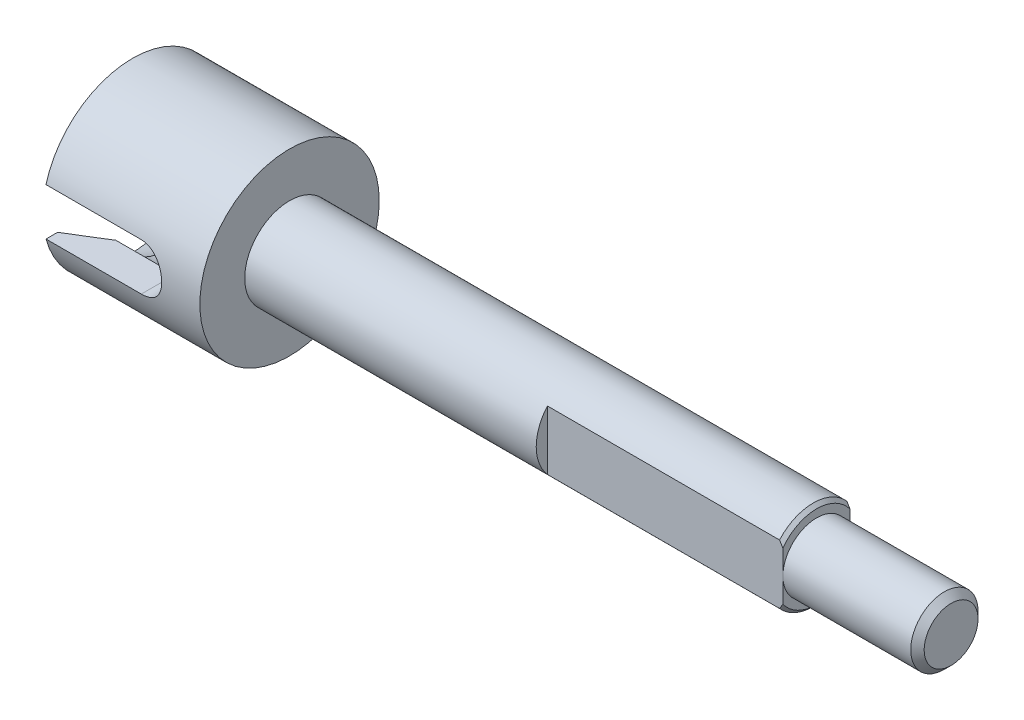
ISO-10303-21;
HEADER;
FILE_DESCRIPTION(('STEP AP214'),'2;1');
FILE_NAME('part.step','',(''),(''),'','','');
FILE_SCHEMA(('AUTOMOTIVE_DESIGN { 1 0 10303 214 1 1 1 1 }'));
ENDSEC;
DATA;
#1=APPLICATION_CONTEXT('core data for automotive mechanical design processes');
#2=APPLICATION_PROTOCOL_DEFINITION('international standard','automotive_design',2000,#1);
#3=PRODUCT_CONTEXT('',#1,'mechanical');
#4=PRODUCT('Part','Part','',(#3));
#5=PRODUCT_RELATED_PRODUCT_CATEGORY('part','',(#4));
#6=PRODUCT_DEFINITION_FORMATION('','',#4);
#7=PRODUCT_DEFINITION_CONTEXT('part definition',#1,'design');
#8=PRODUCT_DEFINITION('design','',#6,#7);
#9=PRODUCT_DEFINITION_SHAPE('','',#8);
#10=(LENGTH_UNIT() NAMED_UNIT(*) SI_UNIT(.MILLI.,.METRE.));
#11=(NAMED_UNIT(*) PLANE_ANGLE_UNIT() SI_UNIT($,.RADIAN.));
#12=(NAMED_UNIT(*) SI_UNIT($,.STERADIAN.) SOLID_ANGLE_UNIT());
#13=UNCERTAINTY_MEASURE_WITH_UNIT(LENGTH_MEASURE(1.E-05),#10,'distance_accuracy_value','');
#14=(GEOMETRIC_REPRESENTATION_CONTEXT(3) GLOBAL_UNCERTAINTY_ASSIGNED_CONTEXT((#13)) GLOBAL_UNIT_ASSIGNED_CONTEXT((#10,
#11,#12)) REPRESENTATION_CONTEXT('',''));
#15=CARTESIAN_POINT('',(0.,0.,0.));
#16=DIRECTION('',(0.,0.,1.));
#17=DIRECTION('',(1.,0.,0.));
#18=AXIS2_PLACEMENT_3D('',#15,#16,#17);
#19=CARTESIAN_POINT('',(-3.40000000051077,0.,0.));
#20=DIRECTION('',(-1.,0.,0.));
#21=DIRECTION('',(0.,0.,1.));
#22=AXIS2_PLACEMENT_3D('',#19,#20,#21);
#23=CONICAL_SURFACE('',#22,5.15000000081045,1.04719755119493);
#24=CARTESIAN_POINT('',(-0.426646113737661,0.,0.));
#25=VERTEX_POINT('',#24);
#26=VERTEX_LOOP('',#25);
#27=FACE_BOUND('',#26,.T.);
#28=CARTESIAN_POINT('',(-3.4,0.,0.));
#29=DIRECTION('',(-1.,0.,0.));
#30=DIRECTION('',(0.,0.,1.));
#31=AXIS2_PLACEMENT_3D('',#28,#29,#30);
#32=CIRCLE('',#31,5.15);
#33=CARTESIAN_POINT('',(-3.4,0.,5.15));
#34=VERTEX_POINT('',#33);
#35=CARTESIAN_POINT('',(-3.4,5.72113442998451E-08,-5.15));
#36=VERTEX_POINT('',#35);
#37=EDGE_CURVE('E321',#34,#36,#32,.T.);
#38=ORIENTED_EDGE('',*,*,#37,.T.);
#39=CARTESIAN_POINT('',(-3.4,0.,0.));
#40=DIRECTION('',(-1.,0.,0.));
#41=DIRECTION('',(0.,0.,1.));
#42=AXIS2_PLACEMENT_3D('',#39,#40,#41);
#43=CIRCLE('',#42,5.15);
#44=EDGE_CURVE('E326',#36,#34,#43,.T.);
#45=ORIENTED_EDGE('',*,*,#44,.T.);
#46=EDGE_LOOP('',(#38,#45));
#47=FACE_BOUND('',#46,.T.);
#48=ADVANCED_FACE('F16',(#27,#47),#23,.F.);
#49=CARTESIAN_POINT('',(59.,0.,0.));
#50=DIRECTION('',(1.,0.,0.));
#51=DIRECTION('',(0.,0.,-1.));
#52=AXIS2_PLACEMENT_3D('',#49,#50,#51);
#53=PLANE('',#52);
#54=CARTESIAN_POINT('',(59.,0.,0.));
#55=DIRECTION('',(1.,0.,0.));
#56=DIRECTION('',(0.,0.,-1.));
#57=AXIS2_PLACEMENT_3D('',#54,#55,#56);
#58=CIRCLE('',#57,2.39993252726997);
#59=CARTESIAN_POINT('',(59.,0.,-2.39993252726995));
#60=VERTEX_POINT('',#59);
#61=EDGE_CURVE('E20',#60,#60,#58,.F.);
#62=ORIENTED_EDGE('',*,*,#61,.F.);
#63=EDGE_LOOP('',(#62));
#64=FACE_BOUND('',#63,.T.);
#65=ADVANCED_FACE('F506',(#64),#53,.T.);
#66=CARTESIAN_POINT('',(-13.9999999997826,0.,0.));
#67=DIRECTION('',(-1.,0.,0.));
#68=DIRECTION('',(0.,0.,1.));
#69=AXIS2_PLACEMENT_3D('',#66,#67,#68);
#70=CONICAL_SURFACE('',#69,6.99999999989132,0.523598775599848);
#71=CARTESIAN_POINT('',(-10.7957060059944,-2.1,-4.70239300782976));
#72=CARTESIAN_POINT('',(-11.0608600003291,-2.1,-4.87001047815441));
#73=CARTESIAN_POINT('',(-11.3266459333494,-2.1,-5.03662211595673));
#74=CARTESIAN_POINT('',(-11.8592172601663,-2.1,-5.36822748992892));
#75=CARTESIAN_POINT('',(-12.1260026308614,-2.1,-5.53322126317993));
#76=CARTESIAN_POINT('',(-12.660318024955,-2.1,-5.86199073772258));
#77=CARTESIAN_POINT('',(-12.9278480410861,-2.1,-6.02576645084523));
#78=CARTESIAN_POINT('',(-13.4635109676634,-2.1,-6.35234304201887));
#79=CARTESIAN_POINT('',(-13.7316438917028,-2.1,-6.51514389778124));
#80=CARTESIAN_POINT('',(-13.9999999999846,-2.1,-6.67757440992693));
#81=B_SPLINE_CURVE_WITH_KNOTS('',3,(#71,#72,#73,#74,#75,#76,#77,#78,#79,#80),.UNSPECIFIED.,.F.,
.F.,(4,2,2,2,4),(0.,0.9410670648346,1.88211250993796,2.82314880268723,3.76420652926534),.UNSPECIFIED.);
#82=CARTESIAN_POINT('',(-10.7957060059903,-2.1,-4.7023930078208));
#83=VERTEX_POINT('',#82);
#84=CARTESIAN_POINT('',(-13.9999999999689,-2.1,-6.67757440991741));
#85=VERTEX_POINT('',#84);
#86=EDGE_CURVE('E149',#83,#85,#81,.T.);
#87=ORIENTED_EDGE('',*,*,#86,.T.);
#88=CARTESIAN_POINT('',(-13.9999999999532,0.,0.));
#89=DIRECTION('',(-1.,0.,0.));
#90=DIRECTION('',(0.,0.,1.));
#91=AXIS2_PLACEMENT_3D('',#88,#89,#90);
#92=CIRCLE('',#91,6.99999999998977);
#93=CARTESIAN_POINT('',(-13.9999999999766,-2.1,6.67757440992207));
#94=VERTEX_POINT('',#93);
#95=EDGE_CURVE('E142',#85,#94,#92,.T.);
#96=ORIENTED_EDGE('',*,*,#95,.T.);
#97=CARTESIAN_POINT('',(-13.9999999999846,-2.1,6.67757440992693));
#98=CARTESIAN_POINT('',(-13.7316438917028,-2.1,6.51514389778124));
#99=CARTESIAN_POINT('',(-13.4635109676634,-2.1,6.35234304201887));
#100=CARTESIAN_POINT('',(-12.9278480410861,-2.1,6.02576645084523));
#101=CARTESIAN_POINT('',(-12.660318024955,-2.1,5.86199073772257));
#102=CARTESIAN_POINT('',(-12.1260026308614,-2.1,5.53322126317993));
#103=CARTESIAN_POINT('',(-11.8592172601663,-2.1,5.36822748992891));
#104=CARTESIAN_POINT('',(-11.3266459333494,-2.1,5.03662211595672));
#105=CARTESIAN_POINT('',(-11.0608600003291,-2.1,4.87001047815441));
#106=CARTESIAN_POINT('',(-10.7957060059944,-2.1,4.70239300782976));
#107=B_SPLINE_CURVE_WITH_KNOTS('',3,(#97,#98,#99,#100,#101,#102,#103,#104,#105,#106),
.UNSPECIFIED.,.F.,.F.,(4,2,2,2,4),(0.,0.941057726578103,1.88209401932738,2.82313946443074,
3.76420652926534),.UNSPECIFIED.);
#108=CARTESIAN_POINT('',(-10.7957060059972,-2.1,4.70239300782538));
#109=VERTEX_POINT('',#108);
#110=EDGE_CURVE('E146',#94,#109,#107,.T.);
#111=ORIENTED_EDGE('',*,*,#110,.T.);
#112=CARTESIAN_POINT('',(-10.795706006,0.,0.));
#113=DIRECTION('',(-1.,0.,0.));
#114=DIRECTION('',(0.,0.,1.));
#115=AXIS2_PLACEMENT_3D('',#112,#113,#114);
#116=CIRCLE('',#115,5.15);
#117=EDGE_CURVE('E324',#109,#83,#116,.F.);
#118=ORIENTED_EDGE('',*,*,#117,.T.);
#119=EDGE_LOOP('',(#87,#96,#111,#118));
#120=FACE_BOUND('',#119,.T.);
#121=ADVANCED_FACE('F144',(#120),#70,.F.);
#122=CARTESIAN_POINT('',(-13.9999999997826,0.,0.));
#123=DIRECTION('',(-1.,0.,0.));
#124=DIRECTION('',(0.,0.,1.));
#125=AXIS2_PLACEMENT_3D('',#122,#123,#124);
#126=CONICAL_SURFACE('',#125,6.99999999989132,0.523598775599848);
#127=CARTESIAN_POINT('',(-10.795706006,0.,0.));
#128=DIRECTION('',(-1.,0.,0.));
#129=DIRECTION('',(0.,0.,1.));
#130=AXIS2_PLACEMENT_3D('',#127,#128,#129);
#131=CIRCLE('',#130,5.15);
#132=CARTESIAN_POINT('',(-10.7957060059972,2.1,-4.70239300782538));
#133=VERTEX_POINT('',#132);
#134=CARTESIAN_POINT('',(-10.7957060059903,2.1,4.7023930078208));
#135=VERTEX_POINT('',#134);
#136=EDGE_CURVE('E319',#133,#135,#131,.F.);
#137=ORIENTED_EDGE('',*,*,#136,.T.);
#138=CARTESIAN_POINT('',(-10.7957060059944,2.1,4.70239300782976));
#139=CARTESIAN_POINT('',(-11.0608600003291,2.1,4.87001047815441));
#140=CARTESIAN_POINT('',(-11.3266459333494,2.1,5.03662211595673));
#141=CARTESIAN_POINT('',(-11.8592172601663,2.1,5.36822748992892));
#142=CARTESIAN_POINT('',(-12.1260026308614,2.1,5.53322126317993));
#143=CARTESIAN_POINT('',(-12.660318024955,2.1,5.86199073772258));
#144=CARTESIAN_POINT('',(-12.9278480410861,2.1,6.02576645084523));
#145=CARTESIAN_POINT('',(-13.4635109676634,2.1,6.35234304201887));
#146=CARTESIAN_POINT('',(-13.7316438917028,2.1,6.51514389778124));
#147=CARTESIAN_POINT('',(-13.9999999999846,2.1,6.67757440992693));
#148=B_SPLINE_CURVE_WITH_KNOTS('',3,(#138,#139,#140,#141,#142,#143,#144,#145,#146,#147),
.UNSPECIFIED.,.F.,.F.,(4,2,2,2,4),(0.,0.9410670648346,1.88211250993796,2.82314880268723,
3.76420652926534),.UNSPECIFIED.);
#149=CARTESIAN_POINT('',(-13.9999999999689,2.1,6.67757440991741));
#150=VERTEX_POINT('',#149);
#151=EDGE_CURVE('E210',#135,#150,#148,.T.);
#152=ORIENTED_EDGE('',*,*,#151,.T.);
#153=CARTESIAN_POINT('',(-13.9999999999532,0.,0.));
#154=DIRECTION('',(-1.,0.,0.));
#155=DIRECTION('',(0.,0.,1.));
#156=AXIS2_PLACEMENT_3D('',#153,#154,#155);
#157=CIRCLE('',#156,6.99999999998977);
#158=CARTESIAN_POINT('',(-13.9999999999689,2.1,-6.67757440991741));
#159=VERTEX_POINT('',#158);
#160=EDGE_CURVE('E224',#150,#159,#157,.T.);
#161=ORIENTED_EDGE('',*,*,#160,.T.);
#162=CARTESIAN_POINT('',(-13.9999999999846,2.1,-6.67757440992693));
#163=CARTESIAN_POINT('',(-13.7316438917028,2.1,-6.51514389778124));
#164=CARTESIAN_POINT('',(-13.4635109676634,2.1,-6.35234304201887));
#165=CARTESIAN_POINT('',(-12.9278480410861,2.1,-6.02576645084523));
#166=CARTESIAN_POINT('',(-12.660318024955,2.1,-5.86199073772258));
#167=CARTESIAN_POINT('',(-12.1260026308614,2.1,-5.53322126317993));
#168=CARTESIAN_POINT('',(-11.8592172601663,2.1,-5.36822748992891));
#169=CARTESIAN_POINT('',(-11.3266459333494,2.1,-5.03662211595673));
#170=CARTESIAN_POINT('',(-11.0608600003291,2.1,-4.87001047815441));
#171=CARTESIAN_POINT('',(-10.7957060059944,2.1,-4.70239300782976));
#172=B_SPLINE_CURVE_WITH_KNOTS('',3,(#162,#163,#164,#165,#166,#167,#168,#169,#170,#171),
.UNSPECIFIED.,.F.,.F.,(4,2,2,2,4),(0.,0.941057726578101,1.88209401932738,2.82313946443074,
3.76420652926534),.UNSPECIFIED.);
#173=EDGE_CURVE('E166',#159,#133,#172,.T.);
#174=ORIENTED_EDGE('',*,*,#173,.T.);
#175=EDGE_LOOP('',(#137,#152,#161,#174));
#176=FACE_BOUND('',#175,.T.);
#177=ADVANCED_FACE('F225',(#176),#126,.F.);
#178=CARTESIAN_POINT('',(0.2520215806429,0.,0.));
#179=DIRECTION('',(-1.,0.,0.));
#180=DIRECTION('',(0.,0.,1.));
#181=AXIS2_PLACEMENT_3D('',#178,#179,#180);
#182=CYLINDRICAL_SURFACE('',#181,5.15);
#183=ORIENTED_EDGE('',*,*,#37,.F.);
#184=CARTESIAN_POINT('',(-3.4,0.,5.15));
#185=CARTESIAN_POINT('',(-3.39999196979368,0.056592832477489,5.15000858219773));
#186=CARTESIAN_POINT('',(-3.40228748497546,0.113180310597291,5.14906737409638));
#187=CARTESIAN_POINT('',(-3.41142323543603,0.225909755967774,5.14534945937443));
#188=CARTESIAN_POINT('',(-3.41826208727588,0.282051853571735,5.14257331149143));
#189=CARTESIAN_POINT('',(-3.4363896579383,0.393290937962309,5.13526265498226));
#190=CARTESIAN_POINT('',(-3.44766233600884,0.448390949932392,5.1307344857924));
#191=CARTESIAN_POINT('',(-3.47453374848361,0.55735018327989,5.12004522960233));
#192=CARTESIAN_POINT('',(-3.49013266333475,0.611209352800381,5.11388407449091));
#193=CARTESIAN_POINT('',(-3.54319014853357,0.770296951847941,5.09318431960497));
#194=CARTESIAN_POINT('',(-3.58693939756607,0.873216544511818,5.07641677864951));
#195=CARTESIAN_POINT('',(-3.68974879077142,1.070220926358,5.03857461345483));
#196=CARTESIAN_POINT('',(-3.74882075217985,1.16429881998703,5.017496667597));
#197=CARTESIAN_POINT('',(-3.88358529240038,1.34554852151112,4.97203194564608));
#198=CARTESIAN_POINT('',(-3.95989199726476,1.43223806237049,4.94754074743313));
#199=CARTESIAN_POINT('',(-4.12566235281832,1.59199846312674,4.89847334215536));
#200=CARTESIAN_POINT('',(-4.21513202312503,1.66506305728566,4.87389710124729));
#201=CARTESIAN_POINT('',(-4.40979601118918,1.7989032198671,4.82615183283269));
#202=CARTESIAN_POINT('',(-4.51553298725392,1.85893655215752,4.80310386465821));
#203=CARTESIAN_POINT('',(-4.73661697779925,1.9600974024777,4.76271965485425));
#204=CARTESIAN_POINT('',(-4.85195002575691,2.00125184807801,4.7453752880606));
#205=CARTESIAN_POINT('',(-5.05635703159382,2.05452562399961,4.72250387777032));
#206=CARTESIAN_POINT('',(-5.14397112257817,2.07151018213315,4.71504127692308));
#207=CARTESIAN_POINT('',(-5.32102792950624,2.09427595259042,4.70494946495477));
#208=CARTESIAN_POINT('',(-5.41047292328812,2.1000422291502,4.70232669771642));
#209=CARTESIAN_POINT('',(-5.5,2.1,4.70239300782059));
#210=B_SPLINE_CURVE_WITH_KNOTS('',3,(#184,#185,#186,#187,#188,#189,#190,#191,#192,#193,#194,
#195,#196,#197,#198,#199,#200,#201,#202,#203,#204,#205,#206,#207,#208,#209),.UNSPECIFIED.,.F.,
.F.,(4,2,2,2,2,2,2,2,2,2,2,2,4),(0.,0.169715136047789,0.33937861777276,0.508433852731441,
0.677496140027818,1.01507576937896,1.35291652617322,1.70553903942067,2.0583233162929,
2.42774830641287,2.79664472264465,3.06450234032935,3.33271633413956),.UNSPECIFIED.);
#211=CARTESIAN_POINT('',(-5.5,2.1,4.7023930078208));
#212=VERTEX_POINT('',#211);
#213=EDGE_CURVE('E245',#34,#212,#210,.T.);
#214=ORIENTED_EDGE('',*,*,#213,.T.);
#215=DIRECTION('',(1.,0.,0.));
#216=VECTOR('',#215,1.);
#217=CARTESIAN_POINT('',(-5.5,2.1,4.702393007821));
#218=LINE('',#217,#216);
#219=EDGE_CURVE('E217',#212,#135,#218,.F.);
#220=ORIENTED_EDGE('',*,*,#219,.T.);
#221=ORIENTED_EDGE('',*,*,#136,.F.);
#222=DIRECTION('',(1.,0.,0.));
#223=VECTOR('',#222,1.);
#224=CARTESIAN_POINT('',(-5.5,2.1,-4.702393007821));
#225=LINE('',#224,#223);
#226=CARTESIAN_POINT('',(-5.5,2.1,-4.7023930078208));
#227=VERTEX_POINT('',#226);
#228=EDGE_CURVE('E476',#133,#227,#225,.T.);
#229=ORIENTED_EDGE('',*,*,#228,.T.);
#230=CARTESIAN_POINT('',(-5.5,2.1,-4.70239300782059));
#231=CARTESIAN_POINT('',(-5.4436048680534,2.10000848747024,-4.70238109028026));
#232=CARTESIAN_POINT('',(-5.38721624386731,2.09772851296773,-4.70340722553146));
#233=CARTESIAN_POINT('',(-5.27489629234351,2.08865800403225,-4.70744650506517));
#234=CARTESIAN_POINT('',(-5.21896479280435,2.08186925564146,-4.71045886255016));
#235=CARTESIAN_POINT('',(-5.10818741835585,2.06388470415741,-4.71836525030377));
#236=CARTESIAN_POINT('',(-5.05333801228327,2.05270722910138,-4.72325145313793));
#237=CARTESIAN_POINT('',(-4.94488445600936,2.02607221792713,-4.73473766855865));
#238=CARTESIAN_POINT('',(-4.8912803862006,2.01061440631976,-4.74133779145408));
#239=CARTESIAN_POINT('',(-4.73299676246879,1.95806782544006,-4.76339445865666));
#240=CARTESIAN_POINT('',(-4.63062004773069,1.91476867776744,-4.78112473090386));
#241=CARTESIAN_POINT('',(-4.43453349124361,1.81301474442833,-4.8206267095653));
#242=CARTESIAN_POINT('',(-4.3408327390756,1.75454430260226,-4.84240258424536));
#243=CARTESIAN_POINT('',(-4.15925775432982,1.62043508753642,-4.88896560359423));
#244=CARTESIAN_POINT('',(-4.07196134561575,1.54404660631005,-4.91385143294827));
#245=CARTESIAN_POINT('',(-3.91100449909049,1.37785430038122,-4.96301523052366));
#246=CARTESIAN_POINT('',(-3.83734724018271,1.28804735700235,-4.98729305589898));
#247=CARTESIAN_POINT('',(-3.70277313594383,1.09297256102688,-5.0337228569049));
#248=CARTESIAN_POINT('',(-3.6425154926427,0.987216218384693,-5.05574400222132));
#249=CARTESIAN_POINT('',(-3.54094020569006,0.766063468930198,-5.09393631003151));
#250=CARTESIAN_POINT('',(-3.49960056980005,0.65067844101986,-5.1101142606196));
#251=CARTESIAN_POINT('',(-3.445909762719,0.445770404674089,-5.13140990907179));
#252=CARTESIAN_POINT('',(-3.4287450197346,0.357678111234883,-5.13833462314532));
#253=CARTESIAN_POINT('',(-3.41152641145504,0.224264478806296,-5.1453082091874));
#254=CARTESIAN_POINT('',(-3.40720826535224,0.17955138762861,-5.14706385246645));
#255=CARTESIAN_POINT('',(-3.40144373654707,0.0898961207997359,-5.14941117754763));
#256=CARTESIAN_POINT('',(-3.39999825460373,0.0449538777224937,-5.15000249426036));
#257=CARTESIAN_POINT('',(-3.4,7.62817921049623E-08,-5.15));
#258=B_SPLINE_CURVE_WITH_KNOTS('',3,(#230,#231,#232,#233,#234,#235,#236,#237,#238,#239,#240,
#241,#242,#243,#244,#245,#246,#247,#248,#249,#250,#251,#252,#253,#254,#255,#256,#257),
.UNSPECIFIED.,.F.,.F.,(4,2,2,2,2,2,2,2,2,2,2,2,2,4),(0.,0.169119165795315,0.338171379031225,
0.506524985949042,0.674889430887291,1.01093859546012,1.34733593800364,1.70168615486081,
2.05611885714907,2.42532849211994,2.79410782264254,3.06329759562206,3.19806701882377,
3.33287869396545),.UNSPECIFIED.);
#259=EDGE_CURVE('E240',#227,#36,#258,.T.);
#260=ORIENTED_EDGE('',*,*,#259,.T.);
#261=EDGE_LOOP('',(#183,#214,#220,#221,#229,#260));
#262=FACE_BOUND('',#261,.T.);
#263=ADVANCED_FACE('F229',(#262),#182,.F.);
#264=CARTESIAN_POINT('',(0.2520215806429,0.,0.));
#265=DIRECTION('',(-1.,0.,0.));
#266=DIRECTION('',(0.,0.,1.));
#267=AXIS2_PLACEMENT_3D('',#264,#265,#266);
#268=CYLINDRICAL_SURFACE('',#267,5.15);
#269=DIRECTION('',(1.,0.,0.));
#270=VECTOR('',#269,1.);
#271=CARTESIAN_POINT('',(-14.,-2.1,-4.702393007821));
#272=LINE('',#271,#270);
#273=CARTESIAN_POINT('',(-5.5,-2.1,-4.7023930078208));
#274=VERTEX_POINT('',#273);
#275=EDGE_CURVE('E469',#274,#83,#272,.F.);
#276=ORIENTED_EDGE('',*,*,#275,.T.);
#277=ORIENTED_EDGE('',*,*,#117,.F.);
#278=DIRECTION('',(1.,0.,0.));
#279=VECTOR('',#278,1.);
#280=CARTESIAN_POINT('',(-14.,-2.1,4.702393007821));
#281=LINE('',#280,#279);
#282=CARTESIAN_POINT('',(-5.5,-2.1,4.7023930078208));
#283=VERTEX_POINT('',#282);
#284=EDGE_CURVE('E164',#109,#283,#281,.T.);
#285=ORIENTED_EDGE('',*,*,#284,.T.);
#286=CARTESIAN_POINT('',(-5.5,-2.1,4.70239300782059));
#287=CARTESIAN_POINT('',(-5.44360486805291,-2.10000848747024,4.70238109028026));
#288=CARTESIAN_POINT('',(-5.38721624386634,-2.0977285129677,4.70340722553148));
#289=CARTESIAN_POINT('',(-5.27489629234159,-2.08865800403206,4.70744650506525));
#290=CARTESIAN_POINT('',(-5.21896479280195,-2.08186925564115,4.7104588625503));
#291=CARTESIAN_POINT('',(-5.10818741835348,-2.06388470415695,4.71836525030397));
#292=CARTESIAN_POINT('',(-5.05333801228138,-2.05270722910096,4.72325145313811));
#293=CARTESIAN_POINT('',(-4.94488445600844,-2.02607221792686,4.73473766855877));
#294=CARTESIAN_POINT('',(-4.89128038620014,-2.01061440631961,4.74133779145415));
#295=CARTESIAN_POINT('',(-4.73299676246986,-1.95806782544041,4.76339445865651));
#296=CARTESIAN_POINT('',(-4.63062004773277,-1.9147686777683,4.7811247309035));
#297=CARTESIAN_POINT('',(-4.43453349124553,-1.81301474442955,4.82062670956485));
#298=CARTESIAN_POINT('',(-4.34083273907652,-1.75454430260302,4.84240258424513));
#299=CARTESIAN_POINT('',(-4.15925775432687,-1.62043508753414,4.88896560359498));
#300=CARTESIAN_POINT('',(-4.07196134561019,-1.54404660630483,4.91385143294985));
#301=CARTESIAN_POINT('',(-3.91100449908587,-1.37785430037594,4.96301523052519));
#302=CARTESIAN_POINT('',(-3.83734724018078,-1.28804735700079,4.9872930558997));
#303=CARTESIAN_POINT('',(-3.70277313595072,-1.09297256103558,5.03372285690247));
#304=CARTESIAN_POINT('',(-3.64251549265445,-0.987216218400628,5.05574400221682));
#305=CARTESIAN_POINT('',(-3.54094020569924,-0.766063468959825,5.09393631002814));
#306=CARTESIAN_POINT('',(-3.49960056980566,-0.650678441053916,5.11011426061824));
#307=CARTESIAN_POINT('',(-3.44590975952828,-0.445770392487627,5.13140991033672));
#308=CARTESIAN_POINT('',(-3.42874501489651,-0.357678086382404,5.13833462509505));
#309=CARTESIAN_POINT('',(-3.41152640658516,-0.224264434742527,5.1453082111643));
#310=CARTESIAN_POINT('',(-3.40720826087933,-0.179551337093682,5.14706385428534));
#311=CARTESIAN_POINT('',(-3.4014437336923,-0.0898960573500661,5.14941117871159));
#312=CARTESIAN_POINT('',(-3.39999825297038,-0.0449538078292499,5.1500024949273));
#313=CARTESIAN_POINT('',(-3.4,0.,5.15));
#314=B_SPLINE_CURVE_WITH_KNOTS('',3,(#286,#287,#288,#289,#290,#291,#292,#293,#294,#295,#296,
#297,#298,#299,#300,#301,#302,#303,#304,#305,#306,#307,#308,#309,#310,#311,#312,#313),
.UNSPECIFIED.,.F.,.F.,(4,2,2,2,2,2,2,2,2,2,2,2,2,4),(0.,0.169119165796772,0.338171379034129,
0.506524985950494,0.674889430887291,1.01093859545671,1.34733593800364,1.70168615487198,
2.05611885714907,2.42532849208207,2.79410782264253,3.06329763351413,3.19806707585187,
3.33287877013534),.UNSPECIFIED.);
#315=EDGE_CURVE('E218',#283,#34,#314,.T.);
#316=ORIENTED_EDGE('',*,*,#315,.T.);
#317=ORIENTED_EDGE('',*,*,#44,.F.);
#318=CARTESIAN_POINT('',(-3.4,7.62817923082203E-08,-5.15));
#319=CARTESIAN_POINT('',(-3.39999196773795,-0.0565927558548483,-5.15000858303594));
#320=CARTESIAN_POINT('',(-3.40228748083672,-0.113180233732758,-5.14906737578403));
#321=CARTESIAN_POINT('',(-3.41142322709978,-0.225909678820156,-5.14534946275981));
#322=CARTESIAN_POINT('',(-3.41826207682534,-0.282051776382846,-5.14257331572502));
#323=CARTESIAN_POINT('',(-3.43638964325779,-0.39329086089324,-5.13526266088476));
#324=CARTESIAN_POINT('',(-3.44766231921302,-0.448390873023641,-5.13073449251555));
#325=CARTESIAN_POINT('',(-3.47453372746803,-0.557350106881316,-5.12004523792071));
#326=CARTESIAN_POINT('',(-3.49013264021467,-0.611209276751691,-5.1138840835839));
#327=CARTESIAN_POINT('',(-3.54319011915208,-0.770296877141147,-5.09318433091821));
#328=CARTESIAN_POINT('',(-3.5869393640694,-0.873216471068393,-5.07641679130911));
#329=CARTESIAN_POINT('',(-3.68974874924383,-1.07022085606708,-5.03857462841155));
#330=CARTESIAN_POINT('',(-3.74882070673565,-1.16429875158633,-5.01749668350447));
#331=CARTESIAN_POINT('',(-3.88358523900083,-1.34554845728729,-4.97203196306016));
#332=CARTESIAN_POINT('',(-3.9598919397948,-1.43223800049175,-4.94754076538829));
#333=CARTESIAN_POINT('',(-4.1256622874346,-1.59199840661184,-4.8984733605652));
#334=CARTESIAN_POINT('',(-4.21513195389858,-1.6650630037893,-4.87389711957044));
#335=CARTESIAN_POINT('',(-4.40979593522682,-1.79890317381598,-4.826151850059));
#336=CARTESIAN_POINT('',(-4.51553290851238,-1.85893651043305,-4.80310388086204));
#337=CARTESIAN_POINT('',(-4.73661689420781,-1.96009736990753,-4.76271966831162));
#338=CARTESIAN_POINT('',(-4.85194994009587,-2.00125182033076,-4.74537529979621));
#339=CARTESIAN_POINT('',(-5.05635695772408,-2.05452560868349,-4.72250388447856));
#340=CARTESIAN_POINT('',(-5.14397106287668,-2.07151017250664,-4.71504128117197));
#341=CARTESIAN_POINT('',(-5.32102789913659,-2.09427595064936,-4.70494946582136));
#342=CARTESIAN_POINT('',(-5.41047290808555,-2.10004222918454,-4.70232669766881));
#343=CARTESIAN_POINT('',(-5.5,-2.1,-4.70239300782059));
#344=B_SPLINE_CURVE_WITH_KNOTS('',3,(#318,#319,#320,#321,#322,#323,#324,#325,#326,#327,#328,
#329,#330,#331,#332,#333,#334,#335,#336,#337,#338,#339,#340,#341,#342,#343),.UNSPECIFIED.,.F.,
.F.,(4,2,2,2,2,2,2,2,2,2,2,2,4),(0.,0.169715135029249,0.339378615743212,0.508433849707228,
0.677496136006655,1.01507576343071,1.35291651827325,1.70553902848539,2.05832330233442,
2.42774829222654,2.79664470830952,3.06450237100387,3.33271641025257),.UNSPECIFIED.);
#345=EDGE_CURVE('E266',#36,#274,#344,.T.);
#346=ORIENTED_EDGE('',*,*,#345,.T.);
#347=EDGE_LOOP('',(#276,#277,#285,#316,#317,#346));
#348=FACE_BOUND('',#347,.T.);
#349=ADVANCED_FACE('F234',(#348),#268,.F.);
#350=CARTESIAN_POINT('',(58.3999517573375,0.,0.));
#351=DIRECTION('',(-1.,0.,0.));
#352=DIRECTION('',(0.,-1.,0.));
#353=AXIS2_PLACEMENT_3D('',#350,#351,#352);
#354=CONICAL_SURFACE('',#353,2.99996390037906,0.785384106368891);
#355=CARTESIAN_POINT('',(58.3999156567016,0.,0.));
#356=DIRECTION('',(-1.,0.,0.));
#357=DIRECTION('',(0.,-1.,0.));
#358=AXIS2_PLACEMENT_3D('',#355,#356,#357);
#359=CIRCLE('',#358,3.);
#360=CARTESIAN_POINT('',(58.3999156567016,-3.,0.));
#361=VERTEX_POINT('',#360);
#362=EDGE_CURVE('E265',#361,#361,#359,.T.);
#363=ORIENTED_EDGE('',*,*,#362,.F.);
#364=EDGE_LOOP('',(#363));
#365=FACE_BOUND('',#364,.T.);
#366=ORIENTED_EDGE('',*,*,#61,.T.);
#367=EDGE_LOOP('',(#366));
#368=FACE_BOUND('',#367,.T.);
#369=ADVANCED_FACE('F493',(#365,#368),#354,.T.);
#370=CARTESIAN_POINT('',(-14.,0.,0.));
#371=DIRECTION('',(1.,0.,0.));
#372=DIRECTION('',(0.,0.,-1.));
#373=AXIS2_PLACEMENT_3D('',#370,#371,#372);
#374=PLANE('',#373);
#375=ORIENTED_EDGE('',*,*,#95,.F.);
#376=DIRECTION('',(0.,0.,-1.));
#377=VECTOR('',#376,1.);
#378=CARTESIAN_POINT('',(-14.,-2.1,-9.6));
#379=LINE('',#378,#377);
#380=CARTESIAN_POINT('',(-14.,-2.10000000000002,-7.71945593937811));
#381=VERTEX_POINT('',#380);
#382=EDGE_CURVE('E152',#85,#381,#379,.T.);
#383=ORIENTED_EDGE('',*,*,#382,.T.);
#384=CARTESIAN_POINT('',(-14.,0.,0.));
#385=DIRECTION('',(1.,0.,0.));
#386=DIRECTION('',(0.,0.,-1.));
#387=AXIS2_PLACEMENT_3D('',#384,#385,#386);
#388=CIRCLE('',#387,8.);
#389=CARTESIAN_POINT('',(-14.,-2.10000000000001,7.71945593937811));
#390=VERTEX_POINT('',#389);
#391=EDGE_CURVE('E157',#390,#381,#388,.T.);
#392=ORIENTED_EDGE('',*,*,#391,.F.);
#393=DIRECTION('',(0.,0.,-1.));
#394=VECTOR('',#393,1.);
#395=CARTESIAN_POINT('',(-14.,-2.1,-9.6));
#396=LINE('',#395,#394);
#397=EDGE_CURVE('E154',#390,#94,#396,.T.);
#398=ORIENTED_EDGE('',*,*,#397,.T.);
#399=EDGE_LOOP('',(#375,#383,#392,#398));
#400=FACE_BOUND('',#399,.T.);
#401=ADVANCED_FACE('F155',(#400),#374,.F.);
#402=CARTESIAN_POINT('',(-14.,-2.1,-9.6));
#403=DIRECTION('',(0.,-1.,0.));
#404=DIRECTION('',(0.,0.,-1.));
#405=AXIS2_PLACEMENT_3D('',#402,#403,#404);
#406=PLANE('',#405);
#407=ORIENTED_EDGE('',*,*,#275,.F.);
#408=DIRECTION('',(0.,0.,1.));
#409=VECTOR('',#408,1.);
#410=CARTESIAN_POINT('',(-5.5,-2.1,-9.6));
#411=LINE('',#410,#409);
#412=CARTESIAN_POINT('',(-5.5,-2.10000000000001,-7.71945593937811));
#413=VERTEX_POINT('',#412);
#414=EDGE_CURVE('E262',#274,#413,#411,.F.);
#415=ORIENTED_EDGE('',*,*,#414,.T.);
#416=DIRECTION('',(1.,0.,0.));
#417=VECTOR('',#416,1.);
#418=CARTESIAN_POINT('',(0.,-2.10000000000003,-7.7194559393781));
#419=LINE('',#418,#417);
#420=EDGE_CURVE('E272',#381,#413,#419,.T.);
#421=ORIENTED_EDGE('',*,*,#420,.F.);
#422=ORIENTED_EDGE('',*,*,#382,.F.);
#423=ORIENTED_EDGE('',*,*,#86,.F.);
#424=EDGE_LOOP('',(#407,#415,#421,#422,#423));
#425=FACE_BOUND('',#424,.T.);
#426=ADVANCED_FACE('F190',(#425),#406,.F.);
#427=CARTESIAN_POINT('',(-14.,-2.1,-9.6));
#428=DIRECTION('',(0.,-1.,0.));
#429=DIRECTION('',(0.,0.,-1.));
#430=AXIS2_PLACEMENT_3D('',#427,#428,#429);
#431=PLANE('',#430);
#432=DIRECTION('',(0.,0.,1.));
#433=VECTOR('',#432,1.);
#434=CARTESIAN_POINT('',(-5.5,-2.1,-9.6));
#435=LINE('',#434,#433);
#436=CARTESIAN_POINT('',(-5.5,-2.10000000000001,7.71945593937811));
#437=VERTEX_POINT('',#436);
#438=EDGE_CURVE('E216',#437,#283,#435,.F.);
#439=ORIENTED_EDGE('',*,*,#438,.T.);
#440=ORIENTED_EDGE('',*,*,#284,.F.);
#441=ORIENTED_EDGE('',*,*,#110,.F.);
#442=ORIENTED_EDGE('',*,*,#397,.F.);
#443=DIRECTION('',(1.,0.,0.));
#444=VECTOR('',#443,1.);
#445=CARTESIAN_POINT('',(0.,-2.10000000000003,7.7194559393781));
#446=LINE('',#445,#444);
#447=EDGE_CURVE('E269',#437,#390,#446,.F.);
#448=ORIENTED_EDGE('',*,*,#447,.F.);
#449=EDGE_LOOP('',(#439,#440,#441,#442,#448));
#450=FACE_BOUND('',#449,.T.);
#451=ADVANCED_FACE('F163',(#450),#431,.F.);
#452=CARTESIAN_POINT('',(-5.5,2.1,-9.6));
#453=DIRECTION('',(0.,1.,0.));
#454=DIRECTION('',(0.,0.,1.));
#455=AXIS2_PLACEMENT_3D('',#452,#453,#454);
#456=PLANE('',#455);
#457=DIRECTION('',(0.,0.,1.));
#458=VECTOR('',#457,1.);
#459=CARTESIAN_POINT('',(-5.5,2.1,-9.6));
#460=LINE('',#459,#458);
#461=CARTESIAN_POINT('',(-5.5,2.10000000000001,-7.71945593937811));
#462=VERTEX_POINT('',#461);
#463=EDGE_CURVE('E253',#462,#227,#460,.T.);
#464=ORIENTED_EDGE('',*,*,#463,.T.);
#465=ORIENTED_EDGE('',*,*,#228,.F.);
#466=ORIENTED_EDGE('',*,*,#173,.F.);
#467=DIRECTION('',(0.,0.,-1.));
#468=VECTOR('',#467,1.);
#469=CARTESIAN_POINT('',(-14.,2.1,0.));
#470=LINE('',#469,#468);
#471=CARTESIAN_POINT('',(-14.,2.10000000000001,-7.71945593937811));
#472=VERTEX_POINT('',#471);
#473=EDGE_CURVE('E457',#159,#472,#470,.T.);
#474=ORIENTED_EDGE('',*,*,#473,.T.);
#475=DIRECTION('',(1.,0.,0.));
#476=VECTOR('',#475,1.);
#477=CARTESIAN_POINT('',(0.,2.10000000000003,-7.7194559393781));
#478=LINE('',#477,#476);
#479=EDGE_CURVE('E271',#462,#472,#478,.F.);
#480=ORIENTED_EDGE('',*,*,#479,.F.);
#481=EDGE_LOOP('',(#464,#465,#466,#474,#480));
#482=FACE_BOUND('',#481,.T.);
#483=ADVANCED_FACE('F189',(#482),#456,.F.);
#484=CARTESIAN_POINT('',(-14.,0.,0.));
#485=DIRECTION('',(1.,0.,0.));
#486=DIRECTION('',(0.,0.,-1.));
#487=AXIS2_PLACEMENT_3D('',#484,#485,#486);
#488=PLANE('',#487);
#489=ORIENTED_EDGE('',*,*,#473,.F.);
#490=ORIENTED_EDGE('',*,*,#160,.F.);
#491=DIRECTION('',(0.,0.,1.));
#492=VECTOR('',#491,1.);
#493=CARTESIAN_POINT('',(-14.,2.1,-9.6));
#494=LINE('',#493,#492);
#495=CARTESIAN_POINT('',(-14.,2.10000000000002,7.71945593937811));
#496=VERTEX_POINT('',#495);
#497=EDGE_CURVE('E459',#150,#496,#494,.T.);
#498=ORIENTED_EDGE('',*,*,#497,.T.);
#499=CARTESIAN_POINT('',(-14.,0.,0.));
#500=DIRECTION('',(1.,0.,0.));
#501=DIRECTION('',(0.,0.,-1.));
#502=AXIS2_PLACEMENT_3D('',#499,#500,#501);
#503=CIRCLE('',#502,8.);
#504=EDGE_CURVE('E279',#472,#496,#503,.T.);
#505=ORIENTED_EDGE('',*,*,#504,.F.);
#506=EDGE_LOOP('',(#489,#490,#498,#505));
#507=FACE_BOUND('',#506,.T.);
#508=ADVANCED_FACE('F196',(#507),#488,.F.);
#509=CARTESIAN_POINT('',(-5.5,2.1,-9.6));
#510=DIRECTION('',(0.,1.,0.));
#511=DIRECTION('',(0.,0.,1.));
#512=AXIS2_PLACEMENT_3D('',#509,#510,#511);
#513=PLANE('',#512);
#514=ORIENTED_EDGE('',*,*,#219,.F.);
#515=DIRECTION('',(0.,0.,1.));
#516=VECTOR('',#515,1.);
#517=CARTESIAN_POINT('',(-5.5,2.1,-9.6));
#518=LINE('',#517,#516);
#519=CARTESIAN_POINT('',(-5.5,2.10000000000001,7.71945593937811));
#520=VERTEX_POINT('',#519);
#521=EDGE_CURVE('E249',#212,#520,#518,.T.);
#522=ORIENTED_EDGE('',*,*,#521,.T.);
#523=DIRECTION('',(1.,0.,0.));
#524=VECTOR('',#523,1.);
#525=CARTESIAN_POINT('',(0.,2.10000000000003,7.7194559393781));
#526=LINE('',#525,#524);
#527=EDGE_CURVE('E275',#496,#520,#526,.T.);
#528=ORIENTED_EDGE('',*,*,#527,.F.);
#529=ORIENTED_EDGE('',*,*,#497,.F.);
#530=ORIENTED_EDGE('',*,*,#151,.F.);
#531=EDGE_LOOP('',(#514,#522,#528,#529,#530));
#532=FACE_BOUND('',#531,.T.);
#533=ADVANCED_FACE('F200',(#532),#513,.F.);
#534=CARTESIAN_POINT('',(-5.5,0.,-9.6));
#535=DIRECTION('',(0.,0.,1.));
#536=DIRECTION('',(1.,0.,0.));
#537=AXIS2_PLACEMENT_3D('',#534,#535,#536);
#538=CYLINDRICAL_SURFACE('',#537,2.1);
#539=ORIENTED_EDGE('',*,*,#213,.F.);
#540=ORIENTED_EDGE('',*,*,#315,.F.);
#541=ORIENTED_EDGE('',*,*,#438,.F.);
#542=CARTESIAN_POINT('',(-5.5,2.1,7.71945593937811));
#543=CARTESIAN_POINT('',(-5.44201020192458,2.10000082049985,7.71945179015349));
#544=CARTESIAN_POINT('',(-5.38404924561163,2.09759645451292,7.72011021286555));
#545=CARTESIAN_POINT('',(-5.26856285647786,2.08801241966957,7.72270942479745));
#546=CARTESIAN_POINT('',(-5.21103734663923,2.08083361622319,7.72464998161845));
#547=CARTESIAN_POINT('',(-5.03999023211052,2.05224386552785,7.73231578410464));
#548=CARTESIAN_POINT('',(-4.9276472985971,2.02377908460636,7.73988566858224));
#549=CARTESIAN_POINT('',(-4.70954840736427,1.94897367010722,7.75905737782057));
#550=CARTESIAN_POINT('',(-4.60379155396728,1.90263547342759,7.7706586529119));
#551=CARTESIAN_POINT('',(-4.40149771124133,1.79346099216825,7.79657844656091));
#552=CARTESIAN_POINT('',(-4.30496331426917,1.73062008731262,7.81089772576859));
#553=CARTESIAN_POINT('',(-4.1215844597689,1.58861927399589,7.8410239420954));
#554=CARTESIAN_POINT('',(-4.03499506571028,1.50913548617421,7.85685637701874));
#555=CARTESIAN_POINT('',(-3.87618625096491,1.3367737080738,7.88800948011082));
#556=CARTESIAN_POINT('',(-3.80397196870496,1.24389094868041,7.90332996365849));
#557=CARTESIAN_POINT('',(-3.67489922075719,1.04557524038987,7.93202120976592));
#558=CARTESIAN_POINT('',(-3.61830296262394,0.939966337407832,7.94535712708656));
#559=CARTESIAN_POINT('',(-3.52382231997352,0.720395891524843,7.96825960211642));
#560=CARTESIAN_POINT('',(-3.48591543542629,0.606444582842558,7.97783068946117));
#561=CARTESIAN_POINT('',(-3.43875165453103,0.409943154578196,7.98989463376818));
#562=CARTESIAN_POINT('',(-3.42424545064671,0.328692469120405,7.99366432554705));
#563=CARTESIAN_POINT('',(-3.40486793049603,0.164972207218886,7.99871808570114));
#564=CARTESIAN_POINT('',(-3.39999642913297,0.0825026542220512,8.00000220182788));
#565=CARTESIAN_POINT('',(-3.40000501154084,-0.115788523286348,7.99999690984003));
#566=CARTESIAN_POINT('',(-3.40961234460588,-0.231642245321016,7.99746018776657));
#567=CARTESIAN_POINT('',(-3.44773616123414,-0.460050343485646,7.98758161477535));
#568=CARTESIAN_POINT('',(-3.47627040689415,-0.572601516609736,7.98023525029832));
#569=CARTESIAN_POINT('',(-3.55125798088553,-0.791022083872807,7.96155043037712));
#570=CARTESIAN_POINT('',(-3.59768530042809,-0.896900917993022,7.9502177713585));
#571=CARTESIAN_POINT('',(-3.70705541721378,-1.09936029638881,7.9247606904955));
#572=CARTESIAN_POINT('',(-3.76999805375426,-1.1959409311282,7.91063629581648));
#573=CARTESIAN_POINT('',(-3.91211058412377,-1.37924882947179,7.88076647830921));
#574=CARTESIAN_POINT('',(-3.99158333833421,-1.46573688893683,7.86499401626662));
#575=CARTESIAN_POINT('',(-4.16385996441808,-1.62432738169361,7.83377991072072));
#576=CARTESIAN_POINT('',(-4.25666612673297,-1.69642733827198,7.81833832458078));
#577=CARTESIAN_POINT('',(-4.45488257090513,-1.82536120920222,7.78925620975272));
#578=CARTESIAN_POINT('',(-4.56047897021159,-1.88191725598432,7.77565043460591));
#579=CARTESIAN_POINT('',(-4.78007090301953,-1.97634988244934,7.75218826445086));
#580=CARTESIAN_POINT('',(-4.89405979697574,-2.01424104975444,7.74232894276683));
#581=CARTESIAN_POINT('',(-5.09054033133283,-2.06133987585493,7.72989507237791));
#582=CARTESIAN_POINT('',(-5.17172490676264,-2.07581310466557,7.72600634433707));
#583=CARTESIAN_POINT('',(-5.33525791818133,-2.09515009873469,7.72077539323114));
#584=CARTESIAN_POINT('',(-5.41760559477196,-2.10001986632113,7.71943157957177));
#585=CARTESIAN_POINT('',(-5.5,-2.1,7.71945593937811));
#586=B_SPLINE_CURVE_WITH_KNOTS('',3,(#542,#543,#544,#545,#546,#547,#548,#549,#550,#551,#552,
#553,#554,#555,#556,#557,#558,#559,#560,#561,#562,#563,#564,#565,#566,#567,#568,#569,#570,#571,
#572,#573,#574,#575,#576,#577,#578,#579,#580,#581,#582,#583,#584,#585),.UNSPECIFIED.,.F.,.F.,(4,
2,2,2,2,2,2,2,2,2,2,2,2,2,2,2,2,2,2,2,2,4),(0.,0.173859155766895,0.347686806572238,
0.694303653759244,1.04087325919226,1.38753999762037,1.74171278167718,2.09601193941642,
2.45594031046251,2.81543430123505,3.06272879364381,3.31001853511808,3.65707784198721,
4.0044633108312,4.35134572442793,4.6982247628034,5.05212984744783,5.40609579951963,
5.76602935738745,6.12568115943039,6.37277704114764,6.61971843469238),.UNSPECIFIED.);
#587=EDGE_CURVE('E278',#520,#437,#586,.T.);
#588=ORIENTED_EDGE('',*,*,#587,.F.);
#589=ORIENTED_EDGE('',*,*,#521,.F.);
#590=EDGE_LOOP('',(#539,#540,#541,#588,#589));
#591=FACE_BOUND('',#590,.T.);
#592=ADVANCED_FACE('F205',(#591),#538,.F.);
#593=CARTESIAN_POINT('',(-5.5,0.,-9.6));
#594=DIRECTION('',(0.,0.,1.));
#595=DIRECTION('',(1.,0.,0.));
#596=AXIS2_PLACEMENT_3D('',#593,#594,#595);
#597=CYLINDRICAL_SURFACE('',#596,2.1);
#598=ORIENTED_EDGE('',*,*,#414,.F.);
#599=ORIENTED_EDGE('',*,*,#345,.F.);
#600=ORIENTED_EDGE('',*,*,#259,.F.);
#601=ORIENTED_EDGE('',*,*,#463,.F.);
#602=CARTESIAN_POINT('',(-5.5,-2.1,-7.71945593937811));
#603=CARTESIAN_POINT('',(-5.44201020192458,-2.10000082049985,-7.71945179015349));
#604=CARTESIAN_POINT('',(-5.38404924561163,-2.09759645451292,-7.72011021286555));
#605=CARTESIAN_POINT('',(-5.26856285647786,-2.08801241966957,-7.72270942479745));
#606=CARTESIAN_POINT('',(-5.21103734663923,-2.08083361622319,-7.72464998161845));
#607=CARTESIAN_POINT('',(-5.03999023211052,-2.05224386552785,-7.73231578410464));
#608=CARTESIAN_POINT('',(-4.9276472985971,-2.02377908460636,-7.73988566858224));
#609=CARTESIAN_POINT('',(-4.70954840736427,-1.94897367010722,-7.75905737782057));
#610=CARTESIAN_POINT('',(-4.60379155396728,-1.90263547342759,-7.7706586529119));
#611=CARTESIAN_POINT('',(-4.40149771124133,-1.79346099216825,-7.79657844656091));
#612=CARTESIAN_POINT('',(-4.30496331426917,-1.73062008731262,-7.81089772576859));
#613=CARTESIAN_POINT('',(-4.1215844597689,-1.58861927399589,-7.8410239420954));
#614=CARTESIAN_POINT('',(-4.03499506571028,-1.50913548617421,-7.85685637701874));
#615=CARTESIAN_POINT('',(-3.87618625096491,-1.3367737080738,-7.88800948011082));
#616=CARTESIAN_POINT('',(-3.80397196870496,-1.24389094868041,-7.90332996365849));
#617=CARTESIAN_POINT('',(-3.67489922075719,-1.04557524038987,-7.93202120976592));
#618=CARTESIAN_POINT('',(-3.61830296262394,-0.939966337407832,-7.94535712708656));
#619=CARTESIAN_POINT('',(-3.52382231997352,-0.720395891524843,-7.96825960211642));
#620=CARTESIAN_POINT('',(-3.48591543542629,-0.606444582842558,-7.97783068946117));
#621=CARTESIAN_POINT('',(-3.43875165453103,-0.409943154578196,-7.98989463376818));
#622=CARTESIAN_POINT('',(-3.42424545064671,-0.328692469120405,-7.99366432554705));
#623=CARTESIAN_POINT('',(-3.40486793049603,-0.164972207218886,-7.99871808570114));
#624=CARTESIAN_POINT('',(-3.39999642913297,-0.0825026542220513,-8.00000220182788));
#625=CARTESIAN_POINT('',(-3.40000501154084,0.115788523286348,-7.99999690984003));
#626=CARTESIAN_POINT('',(-3.40961234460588,0.231642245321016,-7.99746018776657));
#627=CARTESIAN_POINT('',(-3.44773616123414,0.460050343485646,-7.98758161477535));
#628=CARTESIAN_POINT('',(-3.47627040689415,0.572601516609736,-7.98023525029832));
#629=CARTESIAN_POINT('',(-3.55125798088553,0.791022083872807,-7.96155043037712));
#630=CARTESIAN_POINT('',(-3.59768530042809,0.896900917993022,-7.9502177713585));
#631=CARTESIAN_POINT('',(-3.70705541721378,1.09936029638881,-7.9247606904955));
#632=CARTESIAN_POINT('',(-3.76999805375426,1.1959409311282,-7.91063629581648));
#633=CARTESIAN_POINT('',(-3.91211058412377,1.37924882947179,-7.88076647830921));
#634=CARTESIAN_POINT('',(-3.99158333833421,1.46573688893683,-7.86499401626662));
#635=CARTESIAN_POINT('',(-4.16385996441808,1.62432738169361,-7.83377991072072));
#636=CARTESIAN_POINT('',(-4.25666612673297,1.69642733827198,-7.81833832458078));
#637=CARTESIAN_POINT('',(-4.45488257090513,1.82536120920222,-7.78925620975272));
#638=CARTESIAN_POINT('',(-4.56047897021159,1.88191725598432,-7.77565043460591));
#639=CARTESIAN_POINT('',(-4.78007090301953,1.97634988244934,-7.75218826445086));
#640=CARTESIAN_POINT('',(-4.89405979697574,2.01424104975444,-7.74232894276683));
#641=CARTESIAN_POINT('',(-5.09054033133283,2.06133987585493,-7.72989507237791));
#642=CARTESIAN_POINT('',(-5.17172490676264,2.07581310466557,-7.72600634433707));
#643=CARTESIAN_POINT('',(-5.33525791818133,2.09515009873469,-7.72077539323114));
#644=CARTESIAN_POINT('',(-5.41760559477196,2.10001986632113,-7.71943157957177));
#645=CARTESIAN_POINT('',(-5.5,2.1,-7.71945593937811));
#646=B_SPLINE_CURVE_WITH_KNOTS('',3,(#602,#603,#604,#605,#606,#607,#608,#609,#610,#611,#612,
#613,#614,#615,#616,#617,#618,#619,#620,#621,#622,#623,#624,#625,#626,#627,#628,#629,#630,#631,
#632,#633,#634,#635,#636,#637,#638,#639,#640,#641,#642,#643,#644,#645),.UNSPECIFIED.,.F.,.F.,(4,
2,2,2,2,2,2,2,2,2,2,2,2,2,2,2,2,2,2,2,2,4),(0.,0.173859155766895,0.347686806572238,
0.694303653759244,1.04087325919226,1.38753999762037,1.74171278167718,2.09601193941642,
2.45594031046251,2.81543430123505,3.06272879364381,3.31001853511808,3.65707784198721,
4.0044633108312,4.35134572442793,4.6982247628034,5.05212984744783,5.40609579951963,
5.76602935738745,6.12568115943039,6.37277704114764,6.61971843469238),.UNSPECIFIED.);
#647=EDGE_CURVE('E429',#413,#462,#646,.T.);
#648=ORIENTED_EDGE('',*,*,#647,.F.);
#649=EDGE_LOOP('',(#598,#599,#600,#601,#648));
#650=FACE_BOUND('',#649,.T.);
#651=ADVANCED_FACE('F440',(#650),#597,.F.);
#652=CARTESIAN_POINT('',(47.,0.,0.));
#653=DIRECTION('',(1.,0.,0.));
#654=DIRECTION('',(0.,0.,-1.));
#655=AXIS2_PLACEMENT_3D('',#652,#653,#654);
#656=CYLINDRICAL_SURFACE('',#655,3.);
#657=CARTESIAN_POINT('',(47.,0.,0.));
#658=DIRECTION('',(1.,0.,0.));
#659=DIRECTION('',(0.,0.,-1.));
#660=AXIS2_PLACEMENT_3D('',#657,#658,#659);
#661=CIRCLE('',#660,3.);
#662=CARTESIAN_POINT('',(47.,2.69352691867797E-09,3.));
#663=VERTEX_POINT('',#662);
#664=CARTESIAN_POINT('',(47.,0.,-3.));
#665=VERTEX_POINT('',#664);
#666=EDGE_CURVE('E364',#663,#665,#661,.F.);
#667=ORIENTED_EDGE('',*,*,#666,.F.);
#668=CARTESIAN_POINT('',(47.,0.,0.));
#669=DIRECTION('',(1.,0.,0.));
#670=DIRECTION('',(0.,0.,-1.));
#671=AXIS2_PLACEMENT_3D('',#668,#669,#670);
#672=CIRCLE('',#671,3.);
#673=EDGE_CURVE('E358',#665,#663,#672,.F.);
#674=ORIENTED_EDGE('',*,*,#673,.F.);
#675=EDGE_LOOP('',(#667,#674));
#676=FACE_BOUND('',#675,.T.);
#677=ORIENTED_EDGE('',*,*,#362,.T.);
#678=EDGE_LOOP('',(#677));
#679=FACE_BOUND('',#678,.T.);
#680=ADVANCED_FACE('F443',(#676,#679),#656,.T.);
#681=CARTESIAN_POINT('',(0.,0.,0.));
#682=DIRECTION('',(1.,0.,0.));
#683=DIRECTION('',(0.,0.,-1.));
#684=AXIS2_PLACEMENT_3D('',#681,#682,#683);
#685=CYLINDRICAL_SURFACE('',#684,8.);
#686=CARTESIAN_POINT('',(0.,0.,0.));
#687=DIRECTION('',(1.,0.,0.));
#688=DIRECTION('',(0.,0.,-1.));
#689=AXIS2_PLACEMENT_3D('',#686,#687,#688);
#690=CIRCLE('',#689,8.);
#691=CARTESIAN_POINT('',(0.,0.,-8.));
#692=VERTEX_POINT('',#691);
#693=EDGE_CURVE('E318',#692,#692,#690,.T.);
#694=ORIENTED_EDGE('',*,*,#693,.F.);
#695=EDGE_LOOP('',(#694));
#696=FACE_BOUND('',#695,.T.);
#697=ORIENTED_EDGE('',*,*,#587,.T.);
#698=ORIENTED_EDGE('',*,*,#447,.T.);
#699=ORIENTED_EDGE('',*,*,#391,.T.);
#700=ORIENTED_EDGE('',*,*,#420,.T.);
#701=ORIENTED_EDGE('',*,*,#647,.T.);
#702=ORIENTED_EDGE('',*,*,#479,.T.);
#703=ORIENTED_EDGE('',*,*,#504,.T.);
#704=ORIENTED_EDGE('',*,*,#527,.T.);
#705=EDGE_LOOP('',(#697,#698,#699,#700,#701,#702,#703,#704));
#706=FACE_BOUND('',#705,.T.);
#707=ADVANCED_FACE('F384',(#696,#706),#685,.T.);
#708=CARTESIAN_POINT('',(46.6999458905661,0.,0.));
#709=DIRECTION('',(-1.,0.,0.));
#710=DIRECTION('',(0.,0.,1.));
#711=AXIS2_PLACEMENT_3D('',#708,#709,#710);
#712=CONICAL_SURFACE('',#711,4.00000000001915,0.785391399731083);
#713=CARTESIAN_POINT('',(46.69994589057,0.,0.));
#714=DIRECTION('',(1.,0.,0.));
#715=DIRECTION('',(0.,0.,-1.));
#716=AXIS2_PLACEMENT_3D('',#713,#714,#715);
#717=CIRCLE('',#716,4.);
#718=CARTESIAN_POINT('',(46.6999458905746,-2.64575131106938,-3.));
#719=VERTEX_POINT('',#718);
#720=CARTESIAN_POINT('',(46.6999458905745,-2.64575131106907,3.));
#721=VERTEX_POINT('',#720);
#722=EDGE_CURVE('E293',#719,#721,#717,.F.);
#723=ORIENTED_EDGE('',*,*,#722,.F.);
#724=CARTESIAN_POINT('',(46.6999458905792,-2.64575131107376,-3.));
#725=CARTESIAN_POINT('',(46.7259821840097,-2.60638725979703,-3.));
#726=CARTESIAN_POINT('',(46.7517927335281,-2.56687314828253,-3.));
#727=CARTESIAN_POINT('',(46.8029110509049,-2.48753162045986,-3.));
#728=CARTESIAN_POINT('',(46.8282189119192,-2.44770426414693,-3.));
#729=CARTESIAN_POINT('',(46.8782908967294,-2.36770745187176,-3.));
#730=CARTESIAN_POINT('',(46.9030550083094,-2.32753798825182,-3.));
#731=CARTESIAN_POINT('',(46.9519885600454,-2.24682835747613,-3.));
#732=CARTESIAN_POINT('',(46.9761578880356,-2.20628812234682,-3.));
#733=CARTESIAN_POINT('',(47.0000000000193,-2.16555527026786,-3.));
#734=B_SPLINE_CURVE_WITH_KNOTS('',3,(#724,#725,#726,#727,#728,#729,#730,#731,#732,#733),
.UNSPECIFIED.,.F.,.F.,(4,2,2,2,4),(0.,0.141586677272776,0.283146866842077,0.42471023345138,
0.566300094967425),.UNSPECIFIED.);
#735=CARTESIAN_POINT('',(46.999999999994,-2.16555527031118,-3.));
#736=VERTEX_POINT('',#735);
#737=EDGE_CURVE('E367',#719,#736,#734,.T.);
#738=ORIENTED_EDGE('',*,*,#737,.T.);
#739=CARTESIAN_POINT('',(46.9999999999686,0.,0.));
#740=DIRECTION('',(-1.,0.,0.));
#741=DIRECTION('',(0.,0.,1.));
#742=AXIS2_PLACEMENT_3D('',#739,#740,#741);
#743=CIRCLE('',#742,3.69994994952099);
#744=CARTESIAN_POINT('',(46.999999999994,-2.16555527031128,3.));
#745=VERTEX_POINT('',#744);
#746=EDGE_CURVE('E361',#745,#736,#743,.F.);
#747=ORIENTED_EDGE('',*,*,#746,.F.);
#748=CARTESIAN_POINT('',(47.0000000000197,-2.16555527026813,3.00000000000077));
#749=CARTESIAN_POINT('',(46.9761578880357,-2.20628812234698,3.00000000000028));
#750=CARTESIAN_POINT('',(46.9519885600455,-2.24682835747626,3.00000000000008));
#751=CARTESIAN_POINT('',(46.9030550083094,-2.32753798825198,2.99999999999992));
#752=CARTESIAN_POINT('',(46.8782908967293,-2.36770745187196,2.99999999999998));
#753=CARTESIAN_POINT('',(46.8282189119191,-2.44770426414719,3.00000000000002));
#754=CARTESIAN_POINT('',(46.8029110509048,-2.48753162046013,3.00000000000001));
#755=CARTESIAN_POINT('',(46.751792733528,-2.56687314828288,2.99999999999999));
#756=CARTESIAN_POINT('',(46.7259821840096,-2.60638725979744,2.99999999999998));
#757=CARTESIAN_POINT('',(46.6999458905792,-2.64575131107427,3.));
#758=B_SPLINE_CURVE_WITH_KNOTS('',3,(#748,#749,#750,#751,#752,#753,#754,#755,#756,#757),
.UNSPECIFIED.,.F.,.F.,(4,2,2,2,4),(0.,0.141589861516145,0.283153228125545,0.424713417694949,
0.566300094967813),.UNSPECIFIED.);
#759=EDGE_CURVE('E373',#745,#721,#758,.T.);
#760=ORIENTED_EDGE('',*,*,#759,.T.);
#761=EDGE_LOOP('',(#723,#738,#747,#760));
#762=FACE_BOUND('',#761,.T.);
#763=ADVANCED_FACE('F378',(#762),#712,.T.);
#764=CARTESIAN_POINT('',(47.,0.,0.));
#765=DIRECTION('',(1.,0.,0.));
#766=DIRECTION('',(0.,0.,-1.));
#767=AXIS2_PLACEMENT_3D('',#764,#765,#766);
#768=PLANE('',#767);
#769=DIRECTION('',(0.,1.,0.));
#770=VECTOR('',#769,1.);
#771=CARTESIAN_POINT('',(47.,-2.645751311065,3.));
#772=LINE('',#771,#770);
#773=CARTESIAN_POINT('',(46.9999999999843,2.16555527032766,3.));
#774=VERTEX_POINT('',#773);
#775=EDGE_CURVE('E282',#774,#663,#772,.F.);
#776=ORIENTED_EDGE('',*,*,#775,.T.);
#777=ORIENTED_EDGE('',*,*,#666,.T.);
#778=DIRECTION('',(0.,1.,0.));
#779=VECTOR('',#778,1.);
#780=CARTESIAN_POINT('',(47.,2.645751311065,-3.));
#781=LINE('',#780,#779);
#782=CARTESIAN_POINT('',(46.9999999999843,2.16555527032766,-3.));
#783=VERTEX_POINT('',#782);
#784=EDGE_CURVE('E301',#665,#783,#781,.T.);
#785=ORIENTED_EDGE('',*,*,#784,.T.);
#786=CARTESIAN_POINT('',(46.9999999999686,0.,0.));
#787=DIRECTION('',(-1.,0.,0.));
#788=DIRECTION('',(0.,0.,1.));
#789=AXIS2_PLACEMENT_3D('',#786,#787,#788);
#790=CIRCLE('',#789,3.69994994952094);
#791=EDGE_CURVE('E303',#774,#783,#790,.T.);
#792=ORIENTED_EDGE('',*,*,#791,.F.);
#793=EDGE_LOOP('',(#776,#777,#785,#792));
#794=FACE_BOUND('',#793,.T.);
#795=ADVANCED_FACE('F383',(#794),#768,.T.);
#796=CARTESIAN_POINT('',(47.,0.,0.));
#797=DIRECTION('',(1.,0.,0.));
#798=DIRECTION('',(0.,0.,-1.));
#799=AXIS2_PLACEMENT_3D('',#796,#797,#798);
#800=PLANE('',#799);
#801=DIRECTION('',(0.,1.,0.));
#802=VECTOR('',#801,1.);
#803=CARTESIAN_POINT('',(47.,2.645751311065,-3.));
#804=LINE('',#803,#802);
#805=EDGE_CURVE('E294',#736,#665,#804,.T.);
#806=ORIENTED_EDGE('',*,*,#805,.T.);
#807=ORIENTED_EDGE('',*,*,#673,.T.);
#808=DIRECTION('',(0.,1.,0.));
#809=VECTOR('',#808,1.);
#810=CARTESIAN_POINT('',(47.,-2.645751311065,3.));
#811=LINE('',#810,#809);
#812=EDGE_CURVE('E290',#663,#745,#811,.F.);
#813=ORIENTED_EDGE('',*,*,#812,.T.);
#814=ORIENTED_EDGE('',*,*,#746,.T.);
#815=EDGE_LOOP('',(#806,#807,#813,#814));
#816=FACE_BOUND('',#815,.T.);
#817=ADVANCED_FACE('F391',(#816),#800,.T.);
#818=CARTESIAN_POINT('',(0.,0.,0.));
#819=DIRECTION('',(1.,0.,0.));
#820=DIRECTION('',(0.,0.,-1.));
#821=AXIS2_PLACEMENT_3D('',#818,#819,#820);
#822=PLANE('',#821);
#823=CARTESIAN_POINT('',(0.,0.,0.));
#824=DIRECTION('',(1.,0.,0.));
#825=DIRECTION('',(0.,0.,-1.));
#826=AXIS2_PLACEMENT_3D('',#823,#824,#825);
#827=CIRCLE('',#826,4.);
#828=CARTESIAN_POINT('',(0.,0.,-4.));
#829=VERTEX_POINT('',#828);
#830=EDGE_CURVE('E305',#829,#829,#827,.T.);
#831=ORIENTED_EDGE('',*,*,#830,.F.);
#832=EDGE_LOOP('',(#831));
#833=FACE_BOUND('',#832,.T.);
#834=ORIENTED_EDGE('',*,*,#693,.T.);
#835=EDGE_LOOP('',(#834));
#836=FACE_BOUND('',#835,.T.);
#837=ADVANCED_FACE('F395',(#833,#836),#822,.T.);
#838=CARTESIAN_POINT('',(26.,0.,0.));
#839=DIRECTION('',(1.,0.,0.));
#840=DIRECTION('',(0.,0.,-1.));
#841=AXIS2_PLACEMENT_3D('',#838,#839,#840);
#842=PLANE('',#841);
#843=DIRECTION('',(0.,1.,0.));
#844=VECTOR('',#843,1.);
#845=CARTESIAN_POINT('',(26.,-2.645751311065,3.));
#846=LINE('',#845,#844);
#847=CARTESIAN_POINT('',(26.,-2.64575131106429,3.));
#848=VERTEX_POINT('',#847);
#849=CARTESIAN_POINT('',(26.,2.64575131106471,2.9999999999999));
#850=VERTEX_POINT('',#849);
#851=EDGE_CURVE('E286',#848,#850,#846,.T.);
#852=ORIENTED_EDGE('',*,*,#851,.T.);
#853=CARTESIAN_POINT('',(26.,0.,0.));
#854=DIRECTION('',(1.,0.,0.));
#855=DIRECTION('',(0.,0.,-1.));
#856=AXIS2_PLACEMENT_3D('',#853,#854,#855);
#857=CIRCLE('',#856,4.);
#858=EDGE_CURVE('E314',#848,#850,#857,.F.);
#859=ORIENTED_EDGE('',*,*,#858,.F.);
#860=EDGE_LOOP('',(#852,#859));
#861=FACE_BOUND('',#860,.T.);
#862=ADVANCED_FACE('F398',(#861),#842,.T.);
#863=CARTESIAN_POINT('',(26.,-2.645751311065,3.));
#864=DIRECTION('',(0.,0.,-1.));
#865=DIRECTION('',(-1.,0.,0.));
#866=AXIS2_PLACEMENT_3D('',#863,#864,#865);
#867=PLANE('',#866);
#868=CARTESIAN_POINT('',(46.699945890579,2.64575131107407,3.));
#869=CARTESIAN_POINT('',(46.7259821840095,2.60638725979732,3.));
#870=CARTESIAN_POINT('',(46.7517927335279,2.56687314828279,3.));
#871=CARTESIAN_POINT('',(46.8029110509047,2.48753162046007,3.));
#872=CARTESIAN_POINT('',(46.828218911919,2.44770426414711,3.));
#873=CARTESIAN_POINT('',(46.8782908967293,2.36770745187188,3.));
#874=CARTESIAN_POINT('',(46.9030550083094,2.32753798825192,3.));
#875=CARTESIAN_POINT('',(46.9519885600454,2.24682835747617,3.));
#876=CARTESIAN_POINT('',(46.9761578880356,2.20628812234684,3.));
#877=CARTESIAN_POINT('',(47.0000000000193,2.16555527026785,3.));
#878=B_SPLINE_CURVE_WITH_KNOTS('',3,(#868,#869,#870,#871,#872,#873,#874,#875,#876,#877),
.UNSPECIFIED.,.F.,.F.,(4,2,2,2,4),(0.,0.141586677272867,0.28314686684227,0.424710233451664,
0.566300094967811),.UNSPECIFIED.);
#879=CARTESIAN_POINT('',(46.6999458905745,2.64575131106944,2.9999999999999));
#880=VERTEX_POINT('',#879);
#881=EDGE_CURVE('E285',#880,#774,#878,.T.);
#882=ORIENTED_EDGE('',*,*,#881,.F.);
#883=DIRECTION('',(1.,0.,0.));
#884=VECTOR('',#883,1.);
#885=CARTESIAN_POINT('',(0.,2.64575131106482,2.9999999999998));
#886=LINE('',#885,#884);
#887=EDGE_CURVE('E311',#850,#880,#886,.T.);
#888=ORIENTED_EDGE('',*,*,#887,.F.);
#889=ORIENTED_EDGE('',*,*,#851,.F.);
#890=DIRECTION('',(-1.,0.,0.));
#891=VECTOR('',#890,1.);
#892=CARTESIAN_POINT('',(26.,-2.645751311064,3.));
#893=LINE('',#892,#891);
#894=EDGE_CURVE('E287',#721,#848,#893,.T.);
#895=ORIENTED_EDGE('',*,*,#894,.F.);
#896=ORIENTED_EDGE('',*,*,#759,.F.);
#897=ORIENTED_EDGE('',*,*,#812,.F.);
#898=ORIENTED_EDGE('',*,*,#775,.F.);
#899=EDGE_LOOP('',(#882,#888,#889,#895,#896,#897,#898));
#900=FACE_BOUND('',#899,.T.);
#901=ADVANCED_FACE('F346',(#900),#867,.F.);
#902=CARTESIAN_POINT('',(46.6999458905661,0.,0.));
#903=DIRECTION('',(-1.,0.,0.));
#904=DIRECTION('',(0.,0.,1.));
#905=AXIS2_PLACEMENT_3D('',#902,#903,#904);
#906=CONICAL_SURFACE('',#905,4.0000000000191,0.785391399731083);
#907=ORIENTED_EDGE('',*,*,#791,.T.);
#908=CARTESIAN_POINT('',(47.0000000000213,2.16555527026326,-2.99999999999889));
#909=CARTESIAN_POINT('',(46.9761578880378,2.20628812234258,-2.9999999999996));
#910=CARTESIAN_POINT('',(46.9519885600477,2.24682835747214,-2.99999999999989));
#911=CARTESIAN_POINT('',(46.9030550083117,2.32753798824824,-3.00000000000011));
#912=CARTESIAN_POINT('',(46.8782908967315,2.36770745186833,-3.00000000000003));
#913=CARTESIAN_POINT('',(46.8282189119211,2.44770426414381,-2.99999999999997));
#914=CARTESIAN_POINT('',(46.8029110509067,2.48753162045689,-2.99999999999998));
#915=CARTESIAN_POINT('',(46.7517927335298,2.56687314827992,-3.00000000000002));
#916=CARTESIAN_POINT('',(46.7259821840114,2.60638725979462,-3.00000000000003));
#917=CARTESIAN_POINT('',(46.6999458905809,2.64575131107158,-3.));
#918=B_SPLINE_CURVE_WITH_KNOTS('',3,(#908,#909,#910,#911,#912,#913,#914,#915,#916,#917),
.UNSPECIFIED.,.F.,.F.,(4,2,2,2,4),(0.,0.141589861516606,0.28315322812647,0.424713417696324,
0.566300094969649),.UNSPECIFIED.);
#919=CARTESIAN_POINT('',(46.6999458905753,2.64575131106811,-2.99999999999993));
#920=VERTEX_POINT('',#919);
#921=EDGE_CURVE('E300',#783,#920,#918,.T.);
#922=ORIENTED_EDGE('',*,*,#921,.T.);
#923=CARTESIAN_POINT('',(46.69994589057,0.,0.));
#924=DIRECTION('',(1.,0.,0.));
#925=DIRECTION('',(0.,0.,-1.));
#926=AXIS2_PLACEMENT_3D('',#923,#924,#925);
#927=CIRCLE('',#926,4.);
#928=EDGE_CURVE('E308',#880,#920,#927,.F.);
#929=ORIENTED_EDGE('',*,*,#928,.F.);
#930=ORIENTED_EDGE('',*,*,#881,.T.);
#931=EDGE_LOOP('',(#907,#922,#929,#930));
#932=FACE_BOUND('',#931,.T.);
#933=ADVANCED_FACE('F342',(#932),#906,.T.);
#934=CARTESIAN_POINT('',(26.,2.645751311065,-3.));
#935=DIRECTION('',(0.,0.,1.));
#936=DIRECTION('',(1.,0.,0.));
#937=AXIS2_PLACEMENT_3D('',#934,#935,#936);
#938=PLANE('',#937);
#939=ORIENTED_EDGE('',*,*,#737,.F.);
#940=DIRECTION('',(1.,0.,0.));
#941=VECTOR('',#940,1.);
#942=CARTESIAN_POINT('',(26.,-2.645751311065,-3.));
#943=LINE('',#942,#941);
#944=CARTESIAN_POINT('',(26.,-2.6457513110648,-3.));
#945=VERTEX_POINT('',#944);
#946=EDGE_CURVE('E297',#945,#719,#943,.T.);
#947=ORIENTED_EDGE('',*,*,#946,.F.);
#948=DIRECTION('',(0.,1.,0.));
#949=VECTOR('',#948,1.);
#950=CARTESIAN_POINT('',(26.,0.,-3.));
#951=LINE('',#950,#949);
#952=CARTESIAN_POINT('',(26.,2.64575131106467,-2.99999999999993));
#953=VERTEX_POINT('',#952);
#954=EDGE_CURVE('E35',#953,#945,#951,.F.);
#955=ORIENTED_EDGE('',*,*,#954,.F.);
#956=DIRECTION('',(1.,0.,0.));
#957=VECTOR('',#956,1.);
#958=CARTESIAN_POINT('',(0.,2.64575131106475,-2.99999999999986));
#959=LINE('',#958,#957);
#960=EDGE_CURVE('E26',#920,#953,#959,.F.);
#961=ORIENTED_EDGE('',*,*,#960,.F.);
#962=ORIENTED_EDGE('',*,*,#921,.F.);
#963=ORIENTED_EDGE('',*,*,#784,.F.);
#964=ORIENTED_EDGE('',*,*,#805,.F.);
#965=EDGE_LOOP('',(#939,#947,#955,#961,#962,#963,#964));
#966=FACE_BOUND('',#965,.T.);
#967=ADVANCED_FACE('F340',(#966),#938,.F.);
#968=CARTESIAN_POINT('',(26.,0.,0.));
#969=DIRECTION('',(1.,0.,0.));
#970=DIRECTION('',(0.,0.,-1.));
#971=AXIS2_PLACEMENT_3D('',#968,#969,#970);
#972=PLANE('',#971);
#973=ORIENTED_EDGE('',*,*,#954,.T.);
#974=CARTESIAN_POINT('',(26.,0.,0.));
#975=DIRECTION('',(1.,0.,0.));
#976=DIRECTION('',(0.,0.,-1.));
#977=AXIS2_PLACEMENT_3D('',#974,#975,#976);
#978=CIRCLE('',#977,4.);
#979=EDGE_CURVE('E11',#953,#945,#978,.F.);
#980=ORIENTED_EDGE('',*,*,#979,.F.);
#981=EDGE_LOOP('',(#973,#980));
#982=FACE_BOUND('',#981,.T.);
#983=ADVANCED_FACE('F408',(#982),#972,.T.);
#984=CARTESIAN_POINT('',(0.,0.,0.));
#985=DIRECTION('',(1.,0.,0.));
#986=DIRECTION('',(0.,0.,-1.));
#987=AXIS2_PLACEMENT_3D('',#984,#985,#986);
#988=CYLINDRICAL_SURFACE('',#987,4.);
#989=ORIENTED_EDGE('',*,*,#830,.T.);
#990=EDGE_LOOP('',(#989));
#991=FACE_BOUND('',#990,.T.);
#992=ORIENTED_EDGE('',*,*,#960,.T.);
#993=ORIENTED_EDGE('',*,*,#979,.T.);
#994=ORIENTED_EDGE('',*,*,#946,.T.);
#995=ORIENTED_EDGE('',*,*,#722,.T.);
#996=ORIENTED_EDGE('',*,*,#894,.T.);
#997=ORIENTED_EDGE('',*,*,#858,.T.);
#998=ORIENTED_EDGE('',*,*,#887,.T.);
#999=ORIENTED_EDGE('',*,*,#928,.T.);
#1000=EDGE_LOOP('',(#992,#993,#994,#995,#996,#997,#998,#999));
#1001=FACE_BOUND('',#1000,.T.);
#1002=ADVANCED_FACE('F18',(#991,#1001),#988,.T.);
#1003=CLOSED_SHELL('',(#48,#65,#121,#177,#263,#349,#369,#401,#426,#451,#483,#508,#533,#592,#651,
#680,#707,#763,#795,#817,#837,#862,#901,#933,#967,#983,#1002));
#1004=MANIFOLD_SOLID_BREP('B1',#1003);
#1005=ADVANCED_BREP_SHAPE_REPRESENTATION('',(#18,#1004),#14);
#1006=SHAPE_DEFINITION_REPRESENTATION(#9,#1005);
ENDSEC;
END-ISO-10303-21;
